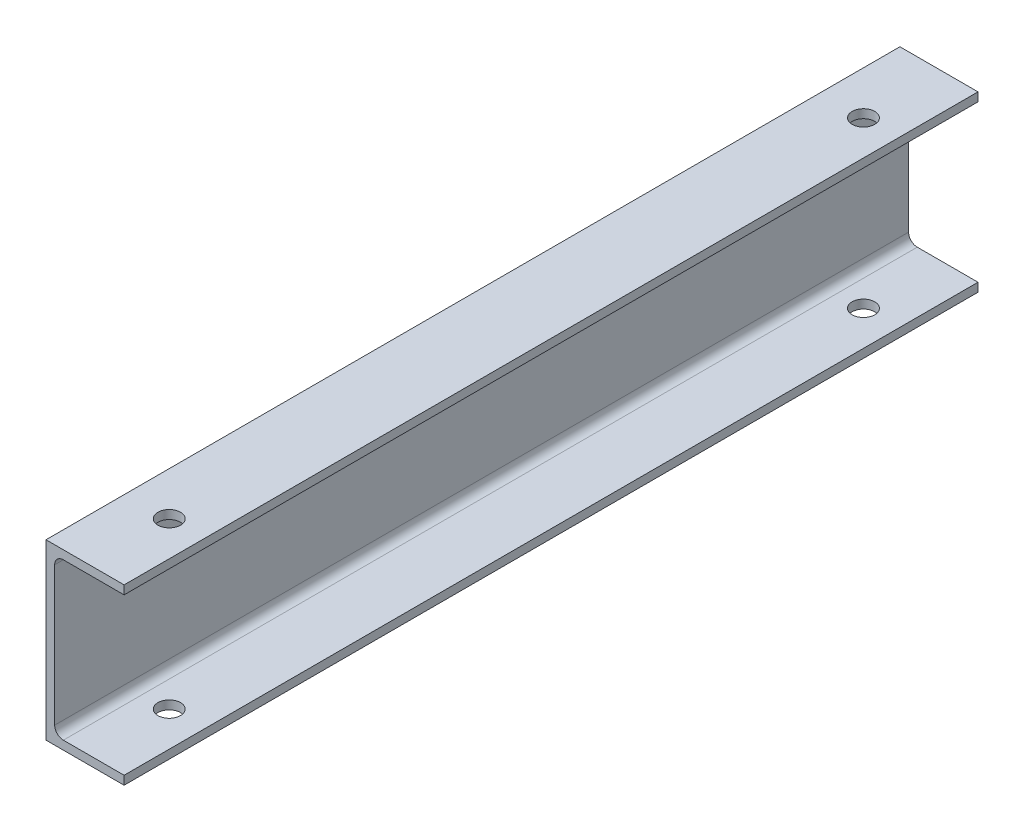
ISO-10303-21;
HEADER;
FILE_DESCRIPTION(('STEP AP214'),'2;1');
FILE_NAME('part.step','',(''),(''),'','','');
FILE_SCHEMA(('AUTOMOTIVE_DESIGN { 1 0 10303 214 1 1 1 1 }'));
ENDSEC;
DATA;
#1=APPLICATION_CONTEXT('core data for automotive mechanical design processes');
#2=APPLICATION_PROTOCOL_DEFINITION('international standard','automotive_design',2000,#1);
#3=PRODUCT_CONTEXT('',#1,'mechanical');
#4=PRODUCT('Part','Part','',(#3));
#5=PRODUCT_RELATED_PRODUCT_CATEGORY('part','',(#4));
#6=PRODUCT_DEFINITION_FORMATION('','',#4);
#7=PRODUCT_DEFINITION_CONTEXT('part definition',#1,'design');
#8=PRODUCT_DEFINITION('design','',#6,#7);
#9=PRODUCT_DEFINITION_SHAPE('','',#8);
#10=(LENGTH_UNIT() NAMED_UNIT(*) SI_UNIT(.MILLI.,.METRE.));
#11=(NAMED_UNIT(*) PLANE_ANGLE_UNIT() SI_UNIT($,.RADIAN.));
#12=(NAMED_UNIT(*) SI_UNIT($,.STERADIAN.) SOLID_ANGLE_UNIT());
#13=UNCERTAINTY_MEASURE_WITH_UNIT(LENGTH_MEASURE(1.E-05),#10,'distance_accuracy_value','');
#14=(GEOMETRIC_REPRESENTATION_CONTEXT(3) GLOBAL_UNCERTAINTY_ASSIGNED_CONTEXT((#13)) GLOBAL_UNIT_ASSIGNED_CONTEXT((#10,
#11,#12)) REPRESENTATION_CONTEXT('',''));
#15=CARTESIAN_POINT('',(0.,0.,0.));
#16=DIRECTION('',(0.,0.,1.));
#17=DIRECTION('',(1.,0.,0.));
#18=AXIS2_PLACEMENT_3D('',#15,#16,#17);
#19=CARTESIAN_POINT('',(45.,0.,492.));
#20=DIRECTION('',(0.,-1.,0.));
#21=DIRECTION('',(1.,0.,0.));
#22=AXIS2_PLACEMENT_3D('',#19,#20,#21);
#23=PLANE('',#22);
#24=CARTESIAN_POINT('',(25.,0.,446.));
#25=DIRECTION('',(0.,1.,0.));
#26=DIRECTION('',(-1.,0.,0.));
#27=AXIS2_PLACEMENT_3D('',#24,#25,#26);
#28=CIRCLE('',#27,6.5);
#29=CARTESIAN_POINT('',(18.5,0.,446.));
#30=VERTEX_POINT('',#29);
#31=EDGE_CURVE('E249',#30,#30,#28,.T.);
#32=ORIENTED_EDGE('',*,*,#31,.F.);
#33=EDGE_LOOP('',(#32));
#34=FACE_BOUND('',#33,.T.);
#35=CARTESIAN_POINT('',(25.,0.,46.));
#36=DIRECTION('',(0.,1.,0.));
#37=DIRECTION('',(-1.,0.,0.));
#38=AXIS2_PLACEMENT_3D('',#35,#36,#37);
#39=CIRCLE('',#38,6.5);
#40=CARTESIAN_POINT('',(18.5,0.,46.));
#41=VERTEX_POINT('',#40);
#42=EDGE_CURVE('E189',#41,#41,#39,.T.);
#43=ORIENTED_EDGE('',*,*,#42,.F.);
#44=EDGE_LOOP('',(#43));
#45=FACE_BOUND('',#44,.T.);
#46=DIRECTION('',(-1.,0.,0.));
#47=VECTOR('',#46,1.);
#48=CARTESIAN_POINT('',(45.,0.,0.));
#49=LINE('',#48,#47);
#50=CARTESIAN_POINT('',(45.,0.,0.));
#51=VERTEX_POINT('',#50);
#52=CARTESIAN_POINT('',(0.,0.,0.));
#53=VERTEX_POINT('',#52);
#54=EDGE_CURVE('E145',#51,#53,#49,.T.);
#55=ORIENTED_EDGE('',*,*,#54,.T.);
#56=DIRECTION('',(0.,0.,-1.));
#57=VECTOR('',#56,1.);
#58=CARTESIAN_POINT('',(0.,0.,492.));
#59=LINE('',#58,#57);
#60=CARTESIAN_POINT('',(0.,0.,492.));
#61=VERTEX_POINT('',#60);
#62=EDGE_CURVE('E11',#61,#53,#59,.T.);
#63=ORIENTED_EDGE('',*,*,#62,.F.);
#64=DIRECTION('',(-1.,0.,0.));
#65=VECTOR('',#64,1.);
#66=CARTESIAN_POINT('',(45.,0.,492.));
#67=LINE('',#66,#65);
#68=CARTESIAN_POINT('',(45.,0.,492.));
#69=VERTEX_POINT('',#68);
#70=EDGE_CURVE('E164',#69,#61,#67,.T.);
#71=ORIENTED_EDGE('',*,*,#70,.F.);
#72=DIRECTION('',(0.,0.,-1.));
#73=VECTOR('',#72,1.);
#74=CARTESIAN_POINT('',(45.,0.,492.));
#75=LINE('',#74,#73);
#76=EDGE_CURVE('E141',#69,#51,#75,.T.);
#77=ORIENTED_EDGE('',*,*,#76,.T.);
#78=EDGE_LOOP('',(#55,#63,#71,#77));
#79=FACE_BOUND('',#78,.T.);
#80=ADVANCED_FACE('F35',(#34,#45,#79),#23,.F.);
#81=CARTESIAN_POINT('',(0.,0.,492.));
#82=DIRECTION('',(1.,0.,0.));
#83=DIRECTION('',(0.,1.,0.));
#84=AXIS2_PLACEMENT_3D('',#81,#82,#83);
#85=PLANE('',#84);
#86=DIRECTION('',(0.,-1.,0.));
#87=VECTOR('',#86,1.);
#88=CARTESIAN_POINT('',(0.,0.,0.));
#89=LINE('',#88,#87);
#90=CARTESIAN_POINT('',(0.,-100.,0.));
#91=VERTEX_POINT('',#90);
#92=EDGE_CURVE('E148',#53,#91,#89,.T.);
#93=ORIENTED_EDGE('',*,*,#92,.T.);
#94=DIRECTION('',(0.,0.,-1.));
#95=VECTOR('',#94,1.);
#96=CARTESIAN_POINT('',(0.,-100.,492.));
#97=LINE('',#96,#95);
#98=CARTESIAN_POINT('',(0.,-100.,492.));
#99=VERTEX_POINT('',#98);
#100=EDGE_CURVE('E44',#99,#91,#97,.T.);
#101=ORIENTED_EDGE('',*,*,#100,.F.);
#102=DIRECTION('',(0.,-1.,0.));
#103=VECTOR('',#102,1.);
#104=CARTESIAN_POINT('',(0.,0.,492.));
#105=LINE('',#104,#103);
#106=EDGE_CURVE('E102',#61,#99,#105,.T.);
#107=ORIENTED_EDGE('',*,*,#106,.F.);
#108=ORIENTED_EDGE('',*,*,#62,.T.);
#109=EDGE_LOOP('',(#93,#101,#107,#108));
#110=FACE_BOUND('',#109,.T.);
#111=ADVANCED_FACE('F238',(#110),#85,.F.);
#112=CARTESIAN_POINT('',(0.,-100.,492.));
#113=DIRECTION('',(0.,1.,0.));
#114=DIRECTION('',(0.,0.,1.));
#115=AXIS2_PLACEMENT_3D('',#112,#113,#114);
#116=PLANE('',#115);
#117=CARTESIAN_POINT('',(25.,-100.,446.));
#118=DIRECTION('',(0.,1.,0.));
#119=DIRECTION('',(-1.,0.,0.));
#120=AXIS2_PLACEMENT_3D('',#117,#118,#119);
#121=CIRCLE('',#120,6.5);
#122=CARTESIAN_POINT('',(18.5,-100.,446.));
#123=VERTEX_POINT('',#122);
#124=EDGE_CURVE('E274',#123,#123,#121,.T.);
#125=ORIENTED_EDGE('',*,*,#124,.T.);
#126=EDGE_LOOP('',(#125));
#127=FACE_BOUND('',#126,.T.);
#128=CARTESIAN_POINT('',(25.,-100.,46.));
#129=DIRECTION('',(0.,1.,0.));
#130=DIRECTION('',(-1.,0.,0.));
#131=AXIS2_PLACEMENT_3D('',#128,#129,#130);
#132=CIRCLE('',#131,6.5);
#133=CARTESIAN_POINT('',(18.5,-100.,46.));
#134=VERTEX_POINT('',#133);
#135=EDGE_CURVE('E183',#134,#134,#132,.T.);
#136=ORIENTED_EDGE('',*,*,#135,.T.);
#137=EDGE_LOOP('',(#136));
#138=FACE_BOUND('',#137,.T.);
#139=DIRECTION('',(1.,0.,0.));
#140=VECTOR('',#139,1.);
#141=CARTESIAN_POINT('',(0.,-100.,0.));
#142=LINE('',#141,#140);
#143=CARTESIAN_POINT('',(45.,-100.,0.));
#144=VERTEX_POINT('',#143);
#145=EDGE_CURVE('E151',#91,#144,#142,.T.);
#146=ORIENTED_EDGE('',*,*,#145,.T.);
#147=DIRECTION('',(0.,0.,-1.));
#148=VECTOR('',#147,1.);
#149=CARTESIAN_POINT('',(45.,-100.,492.));
#150=LINE('',#149,#148);
#151=CARTESIAN_POINT('',(45.,-100.,492.));
#152=VERTEX_POINT('',#151);
#153=EDGE_CURVE('E177',#152,#144,#150,.T.);
#154=ORIENTED_EDGE('',*,*,#153,.F.);
#155=DIRECTION('',(1.,0.,0.));
#156=VECTOR('',#155,1.);
#157=CARTESIAN_POINT('',(0.,-100.,492.));
#158=LINE('',#157,#156);
#159=EDGE_CURVE('E201',#99,#152,#158,.T.);
#160=ORIENTED_EDGE('',*,*,#159,.F.);
#161=ORIENTED_EDGE('',*,*,#100,.T.);
#162=EDGE_LOOP('',(#146,#154,#160,#161));
#163=FACE_BOUND('',#162,.T.);
#164=ADVANCED_FACE('F245',(#127,#138,#163),#116,.F.);
#165=CARTESIAN_POINT('',(45.,-100.,492.));
#166=DIRECTION('',(-1.,0.,0.));
#167=DIRECTION('',(0.,-1.,0.));
#168=AXIS2_PLACEMENT_3D('',#165,#166,#167);
#169=PLANE('',#168);
#170=DIRECTION('',(0.,1.,0.));
#171=VECTOR('',#170,1.);
#172=CARTESIAN_POINT('',(45.,-100.,0.));
#173=LINE('',#172,#171);
#174=CARTESIAN_POINT('',(45.,-95.,0.));
#175=VERTEX_POINT('',#174);
#176=EDGE_CURVE('E153',#144,#175,#173,.T.);
#177=ORIENTED_EDGE('',*,*,#176,.T.);
#178=DIRECTION('',(0.,0.,-1.));
#179=VECTOR('',#178,1.);
#180=CARTESIAN_POINT('',(45.,-95.,492.));
#181=LINE('',#180,#179);
#182=CARTESIAN_POINT('',(45.,-95.,492.));
#183=VERTEX_POINT('',#182);
#184=EDGE_CURVE('E174',#183,#175,#181,.T.);
#185=ORIENTED_EDGE('',*,*,#184,.F.);
#186=DIRECTION('',(0.,1.,0.));
#187=VECTOR('',#186,1.);
#188=CARTESIAN_POINT('',(45.,-100.,492.));
#189=LINE('',#188,#187);
#190=EDGE_CURVE('E203',#152,#183,#189,.T.);
#191=ORIENTED_EDGE('',*,*,#190,.F.);
#192=ORIENTED_EDGE('',*,*,#153,.T.);
#193=EDGE_LOOP('',(#177,#185,#191,#192));
#194=FACE_BOUND('',#193,.T.);
#195=ADVANCED_FACE('F283',(#194),#169,.F.);
#196=CARTESIAN_POINT('',(45.,-95.,492.));
#197=DIRECTION('',(0.,-1.,0.));
#198=DIRECTION('',(0.,0.,-1.));
#199=AXIS2_PLACEMENT_3D('',#196,#197,#198);
#200=PLANE('',#199);
#201=CARTESIAN_POINT('',(25.,-95.,446.));
#202=DIRECTION('',(0.,-1.,0.));
#203=DIRECTION('',(0.,0.,-1.));
#204=AXIS2_PLACEMENT_3D('',#201,#202,#203);
#205=CIRCLE('',#204,6.5);
#206=CARTESIAN_POINT('',(25.,-95.,439.5));
#207=VERTEX_POINT('',#206);
#208=EDGE_CURVE('E194',#207,#207,#205,.T.);
#209=ORIENTED_EDGE('',*,*,#208,.T.);
#210=EDGE_LOOP('',(#209));
#211=FACE_BOUND('',#210,.T.);
#212=CARTESIAN_POINT('',(25.,-95.,46.));
#213=DIRECTION('',(0.,-1.,0.));
#214=DIRECTION('',(0.,0.,-1.));
#215=AXIS2_PLACEMENT_3D('',#212,#213,#214);
#216=CIRCLE('',#215,6.5);
#217=CARTESIAN_POINT('',(25.,-95.,39.5));
#218=VERTEX_POINT('',#217);
#219=EDGE_CURVE('E149',#218,#218,#216,.T.);
#220=ORIENTED_EDGE('',*,*,#219,.T.);
#221=EDGE_LOOP('',(#220));
#222=FACE_BOUND('',#221,.T.);
#223=DIRECTION('',(-1.,0.,0.));
#224=VECTOR('',#223,1.);
#225=CARTESIAN_POINT('',(45.,-95.,0.));
#226=LINE('',#225,#224);
#227=CARTESIAN_POINT('',(10.,-95.,0.));
#228=VERTEX_POINT('',#227);
#229=EDGE_CURVE('E155',#175,#228,#226,.T.);
#230=ORIENTED_EDGE('',*,*,#229,.T.);
#231=DIRECTION('',(0.,0.,-1.));
#232=VECTOR('',#231,1.);
#233=CARTESIAN_POINT('',(10.,-95.,492.));
#234=LINE('',#233,#232);
#235=CARTESIAN_POINT('',(10.,-95.,492.));
#236=VERTEX_POINT('',#235);
#237=EDGE_CURVE('E171',#236,#228,#234,.T.);
#238=ORIENTED_EDGE('',*,*,#237,.F.);
#239=DIRECTION('',(-1.,0.,0.));
#240=VECTOR('',#239,1.);
#241=CARTESIAN_POINT('',(45.,-95.,492.));
#242=LINE('',#241,#240);
#243=EDGE_CURVE('E205',#183,#236,#242,.T.);
#244=ORIENTED_EDGE('',*,*,#243,.F.);
#245=ORIENTED_EDGE('',*,*,#184,.T.);
#246=EDGE_LOOP('',(#230,#238,#244,#245));
#247=FACE_BOUND('',#246,.T.);
#248=ADVANCED_FACE('F294',(#211,#222,#247),#200,.F.);
#249=CARTESIAN_POINT('',(10.,-90.,492.));
#250=DIRECTION('',(0.,0.,-1.));
#251=DIRECTION('',(-1.,0.,0.));
#252=AXIS2_PLACEMENT_3D('',#249,#250,#251);
#253=CYLINDRICAL_SURFACE('',#252,5.);
#254=CARTESIAN_POINT('',(10.,-90.,0.));
#255=DIRECTION('',(0.,0.,-1.));
#256=DIRECTION('',(1.,0.,0.));
#257=AXIS2_PLACEMENT_3D('',#254,#255,#256);
#258=CIRCLE('',#257,5.);
#259=CARTESIAN_POINT('',(5.,-90.,0.));
#260=VERTEX_POINT('',#259);
#261=EDGE_CURVE('E157',#228,#260,#258,.T.);
#262=ORIENTED_EDGE('',*,*,#261,.T.);
#263=DIRECTION('',(0.,0.,-1.));
#264=VECTOR('',#263,1.);
#265=CARTESIAN_POINT('',(5.,-90.,492.));
#266=LINE('',#265,#264);
#267=CARTESIAN_POINT('',(5.,-90.,492.));
#268=VERTEX_POINT('',#267);
#269=EDGE_CURVE('E168',#268,#260,#266,.T.);
#270=ORIENTED_EDGE('',*,*,#269,.F.);
#271=CARTESIAN_POINT('',(10.,-90.,492.));
#272=DIRECTION('',(0.,0.,-1.));
#273=DIRECTION('',(1.,0.,0.));
#274=AXIS2_PLACEMENT_3D('',#271,#272,#273);
#275=CIRCLE('',#274,5.);
#276=EDGE_CURVE('E207',#236,#268,#275,.T.);
#277=ORIENTED_EDGE('',*,*,#276,.F.);
#278=ORIENTED_EDGE('',*,*,#237,.T.);
#279=EDGE_LOOP('',(#262,#270,#277,#278));
#280=FACE_BOUND('',#279,.T.);
#281=ADVANCED_FACE('F213',(#280),#253,.F.);
#282=CARTESIAN_POINT('',(5.,-90.,492.));
#283=DIRECTION('',(-1.,0.,0.));
#284=DIRECTION('',(0.,-1.,0.));
#285=AXIS2_PLACEMENT_3D('',#282,#283,#284);
#286=PLANE('',#285);
#287=DIRECTION('',(0.,1.,0.));
#288=VECTOR('',#287,1.);
#289=CARTESIAN_POINT('',(5.,-90.,0.));
#290=LINE('',#289,#288);
#291=CARTESIAN_POINT('',(5.,-10.,0.));
#292=VERTEX_POINT('',#291);
#293=EDGE_CURVE('E159',#260,#292,#290,.T.);
#294=ORIENTED_EDGE('',*,*,#293,.T.);
#295=DIRECTION('',(0.,0.,-1.));
#296=VECTOR('',#295,1.);
#297=CARTESIAN_POINT('',(5.,-10.,492.));
#298=LINE('',#297,#296);
#299=CARTESIAN_POINT('',(5.,-10.,492.));
#300=VERTEX_POINT('',#299);
#301=EDGE_CURVE('E136',#300,#292,#298,.T.);
#302=ORIENTED_EDGE('',*,*,#301,.F.);
#303=DIRECTION('',(0.,1.,0.));
#304=VECTOR('',#303,1.);
#305=CARTESIAN_POINT('',(5.,-90.,492.));
#306=LINE('',#305,#304);
#307=EDGE_CURVE('E127',#268,#300,#306,.T.);
#308=ORIENTED_EDGE('',*,*,#307,.F.);
#309=ORIENTED_EDGE('',*,*,#269,.T.);
#310=EDGE_LOOP('',(#294,#302,#308,#309));
#311=FACE_BOUND('',#310,.T.);
#312=ADVANCED_FACE('F217',(#311),#286,.F.);
#313=CARTESIAN_POINT('',(10.,-10.,492.));
#314=DIRECTION('',(0.,0.,-1.));
#315=DIRECTION('',(-1.,0.,0.));
#316=AXIS2_PLACEMENT_3D('',#313,#314,#315);
#317=CYLINDRICAL_SURFACE('',#316,5.);
#318=CARTESIAN_POINT('',(10.,-10.,0.));
#319=DIRECTION('',(0.,0.,-1.));
#320=DIRECTION('',(-1.,0.,0.));
#321=AXIS2_PLACEMENT_3D('',#318,#319,#320);
#322=CIRCLE('',#321,5.);
#323=CARTESIAN_POINT('',(10.,-5.,0.));
#324=VERTEX_POINT('',#323);
#325=EDGE_CURVE('E135',#292,#324,#322,.T.);
#326=ORIENTED_EDGE('',*,*,#325,.T.);
#327=DIRECTION('',(0.,0.,-1.));
#328=VECTOR('',#327,1.);
#329=CARTESIAN_POINT('',(10.,-5.,492.));
#330=LINE('',#329,#328);
#331=CARTESIAN_POINT('',(10.,-5.,492.));
#332=VERTEX_POINT('',#331);
#333=EDGE_CURVE('E132',#332,#324,#330,.T.);
#334=ORIENTED_EDGE('',*,*,#333,.F.);
#335=CARTESIAN_POINT('',(10.,-10.,492.));
#336=DIRECTION('',(0.,0.,-1.));
#337=DIRECTION('',(-1.,0.,0.));
#338=AXIS2_PLACEMENT_3D('',#335,#336,#337);
#339=CIRCLE('',#338,5.);
#340=EDGE_CURVE('E121',#300,#332,#339,.T.);
#341=ORIENTED_EDGE('',*,*,#340,.F.);
#342=ORIENTED_EDGE('',*,*,#301,.T.);
#343=EDGE_LOOP('',(#326,#334,#341,#342));
#344=FACE_BOUND('',#343,.T.);
#345=ADVANCED_FACE('F133',(#344),#317,.F.);
#346=CARTESIAN_POINT('',(10.,-5.,492.));
#347=DIRECTION('',(0.,1.,0.));
#348=DIRECTION('',(0.,0.,1.));
#349=AXIS2_PLACEMENT_3D('',#346,#347,#348);
#350=PLANE('',#349);
#351=CARTESIAN_POINT('',(25.,-5.,446.));
#352=DIRECTION('',(0.,1.,0.));
#353=DIRECTION('',(0.,0.,1.));
#354=AXIS2_PLACEMENT_3D('',#351,#352,#353);
#355=CIRCLE('',#354,6.5);
#356=CARTESIAN_POINT('',(25.,-5.,452.5));
#357=VERTEX_POINT('',#356);
#358=EDGE_CURVE('E38',#357,#357,#355,.T.);
#359=ORIENTED_EDGE('',*,*,#358,.T.);
#360=EDGE_LOOP('',(#359));
#361=FACE_BOUND('',#360,.T.);
#362=CARTESIAN_POINT('',(25.,-5.,46.));
#363=DIRECTION('',(0.,1.,0.));
#364=DIRECTION('',(0.,0.,1.));
#365=AXIS2_PLACEMENT_3D('',#362,#363,#364);
#366=CIRCLE('',#365,6.5);
#367=CARTESIAN_POINT('',(25.,-5.,52.5));
#368=VERTEX_POINT('',#367);
#369=EDGE_CURVE('E181',#368,#368,#366,.T.);
#370=ORIENTED_EDGE('',*,*,#369,.T.);
#371=EDGE_LOOP('',(#370));
#372=FACE_BOUND('',#371,.T.);
#373=DIRECTION('',(1.,0.,0.));
#374=VECTOR('',#373,1.);
#375=CARTESIAN_POINT('',(10.,-5.,0.));
#376=LINE('',#375,#374);
#377=CARTESIAN_POINT('',(45.,-5.,0.));
#378=VERTEX_POINT('',#377);
#379=EDGE_CURVE('E88',#324,#378,#376,.T.);
#380=ORIENTED_EDGE('',*,*,#379,.T.);
#381=DIRECTION('',(0.,0.,-1.));
#382=VECTOR('',#381,1.);
#383=CARTESIAN_POINT('',(45.,-5.,492.));
#384=LINE('',#383,#382);
#385=CARTESIAN_POINT('',(45.,-5.,492.));
#386=VERTEX_POINT('',#385);
#387=EDGE_CURVE('E137',#386,#378,#384,.T.);
#388=ORIENTED_EDGE('',*,*,#387,.F.);
#389=DIRECTION('',(1.,0.,0.));
#390=VECTOR('',#389,1.);
#391=CARTESIAN_POINT('',(10.,-5.,492.));
#392=LINE('',#391,#390);
#393=EDGE_CURVE('E125',#332,#386,#392,.T.);
#394=ORIENTED_EDGE('',*,*,#393,.F.);
#395=ORIENTED_EDGE('',*,*,#333,.T.);
#396=EDGE_LOOP('',(#380,#388,#394,#395));
#397=FACE_BOUND('',#396,.T.);
#398=ADVANCED_FACE('F139',(#361,#372,#397),#350,.F.);
#399=CARTESIAN_POINT('',(45.,-5.,492.));
#400=DIRECTION('',(-1.,0.,0.));
#401=DIRECTION('',(0.,0.,1.));
#402=AXIS2_PLACEMENT_3D('',#399,#400,#401);
#403=PLANE('',#402);
#404=DIRECTION('',(0.,1.,0.));
#405=VECTOR('',#404,1.);
#406=CARTESIAN_POINT('',(45.,-5.,0.));
#407=LINE('',#406,#405);
#408=EDGE_CURVE('E94',#378,#51,#407,.T.);
#409=ORIENTED_EDGE('',*,*,#408,.T.);
#410=ORIENTED_EDGE('',*,*,#76,.F.);
#411=DIRECTION('',(0.,1.,0.));
#412=VECTOR('',#411,1.);
#413=CARTESIAN_POINT('',(45.,-5.,492.));
#414=LINE('',#413,#412);
#415=EDGE_CURVE('E53',#386,#69,#414,.T.);
#416=ORIENTED_EDGE('',*,*,#415,.F.);
#417=ORIENTED_EDGE('',*,*,#387,.T.);
#418=EDGE_LOOP('',(#409,#410,#416,#417));
#419=FACE_BOUND('',#418,.T.);
#420=ADVANCED_FACE('F225',(#419),#403,.F.);
#421=CARTESIAN_POINT('',(10.,-90.,492.));
#422=DIRECTION('',(0.,0.,1.));
#423=DIRECTION('',(1.,0.,0.));
#424=AXIS2_PLACEMENT_3D('',#421,#422,#423);
#425=PLANE('',#424);
#426=ORIENTED_EDGE('',*,*,#70,.T.);
#427=ORIENTED_EDGE('',*,*,#106,.T.);
#428=ORIENTED_EDGE('',*,*,#159,.T.);
#429=ORIENTED_EDGE('',*,*,#190,.T.);
#430=ORIENTED_EDGE('',*,*,#243,.T.);
#431=ORIENTED_EDGE('',*,*,#276,.T.);
#432=ORIENTED_EDGE('',*,*,#307,.T.);
#433=ORIENTED_EDGE('',*,*,#340,.T.);
#434=ORIENTED_EDGE('',*,*,#393,.T.);
#435=ORIENTED_EDGE('',*,*,#415,.T.);
#436=EDGE_LOOP('',(#426,#427,#428,#429,#430,#431,#432,#433,#434,#435));
#437=FACE_BOUND('',#436,.T.);
#438=ADVANCED_FACE('F123',(#437),#425,.T.);
#439=CARTESIAN_POINT('',(10.,-90.,0.));
#440=DIRECTION('',(0.,0.,1.));
#441=DIRECTION('',(1.,0.,0.));
#442=AXIS2_PLACEMENT_3D('',#439,#440,#441);
#443=PLANE('',#442);
#444=ORIENTED_EDGE('',*,*,#54,.F.);
#445=ORIENTED_EDGE('',*,*,#408,.F.);
#446=ORIENTED_EDGE('',*,*,#379,.F.);
#447=ORIENTED_EDGE('',*,*,#325,.F.);
#448=ORIENTED_EDGE('',*,*,#293,.F.);
#449=ORIENTED_EDGE('',*,*,#261,.F.);
#450=ORIENTED_EDGE('',*,*,#229,.F.);
#451=ORIENTED_EDGE('',*,*,#176,.F.);
#452=ORIENTED_EDGE('',*,*,#145,.F.);
#453=ORIENTED_EDGE('',*,*,#92,.F.);
#454=EDGE_LOOP('',(#444,#445,#446,#447,#448,#449,#450,#451,#452,#453));
#455=FACE_BOUND('',#454,.T.);
#456=ADVANCED_FACE('F220',(#455),#443,.F.);
#457=CARTESIAN_POINT('',(25.,-100.,46.));
#458=DIRECTION('',(0.,1.,0.));
#459=DIRECTION('',(-1.,0.,0.));
#460=AXIS2_PLACEMENT_3D('',#457,#458,#459);
#461=CYLINDRICAL_SURFACE('',#460,6.5);
#462=ORIENTED_EDGE('',*,*,#42,.T.);
#463=EDGE_LOOP('',(#462));
#464=FACE_BOUND('',#463,.T.);
#465=ORIENTED_EDGE('',*,*,#369,.F.);
#466=EDGE_LOOP('',(#465));
#467=FACE_BOUND('',#466,.T.);
#468=ADVANCED_FACE('F252',(#464,#467),#461,.F.);
#469=ORIENTED_EDGE('',*,*,#135,.F.);
#470=EDGE_LOOP('',(#469));
#471=FACE_BOUND('',#470,.T.);
#472=ORIENTED_EDGE('',*,*,#219,.F.);
#473=EDGE_LOOP('',(#472));
#474=FACE_BOUND('',#473,.T.);
#475=ADVANCED_FACE('F255',(#471,#474),#461,.F.);
#476=CARTESIAN_POINT('',(25.,-100.,446.));
#477=DIRECTION('',(0.,1.,0.));
#478=DIRECTION('',(-1.,0.,0.));
#479=AXIS2_PLACEMENT_3D('',#476,#477,#478);
#480=CYLINDRICAL_SURFACE('',#479,6.5);
#481=ORIENTED_EDGE('',*,*,#31,.T.);
#482=EDGE_LOOP('',(#481));
#483=FACE_BOUND('',#482,.T.);
#484=ORIENTED_EDGE('',*,*,#358,.F.);
#485=EDGE_LOOP('',(#484));
#486=FACE_BOUND('',#485,.T.);
#487=ADVANCED_FACE('F261',(#483,#486),#480,.F.);
#488=ORIENTED_EDGE('',*,*,#124,.F.);
#489=EDGE_LOOP('',(#488));
#490=FACE_BOUND('',#489,.T.);
#491=ORIENTED_EDGE('',*,*,#208,.F.);
#492=EDGE_LOOP('',(#491));
#493=FACE_BOUND('',#492,.T.);
#494=ADVANCED_FACE('F264',(#490,#493),#480,.F.);
#495=CLOSED_SHELL('',(#80,#111,#164,#195,#248,#281,#312,#345,#398,#420,#438,#456,#468,#475,#487,#494));
#496=MANIFOLD_SOLID_BREP('B2',#495);
#497=ADVANCED_BREP_SHAPE_REPRESENTATION('',(#18,#496),#14);
#498=SHAPE_DEFINITION_REPRESENTATION(#9,#497);
ENDSEC;
END-ISO-10303-21;
